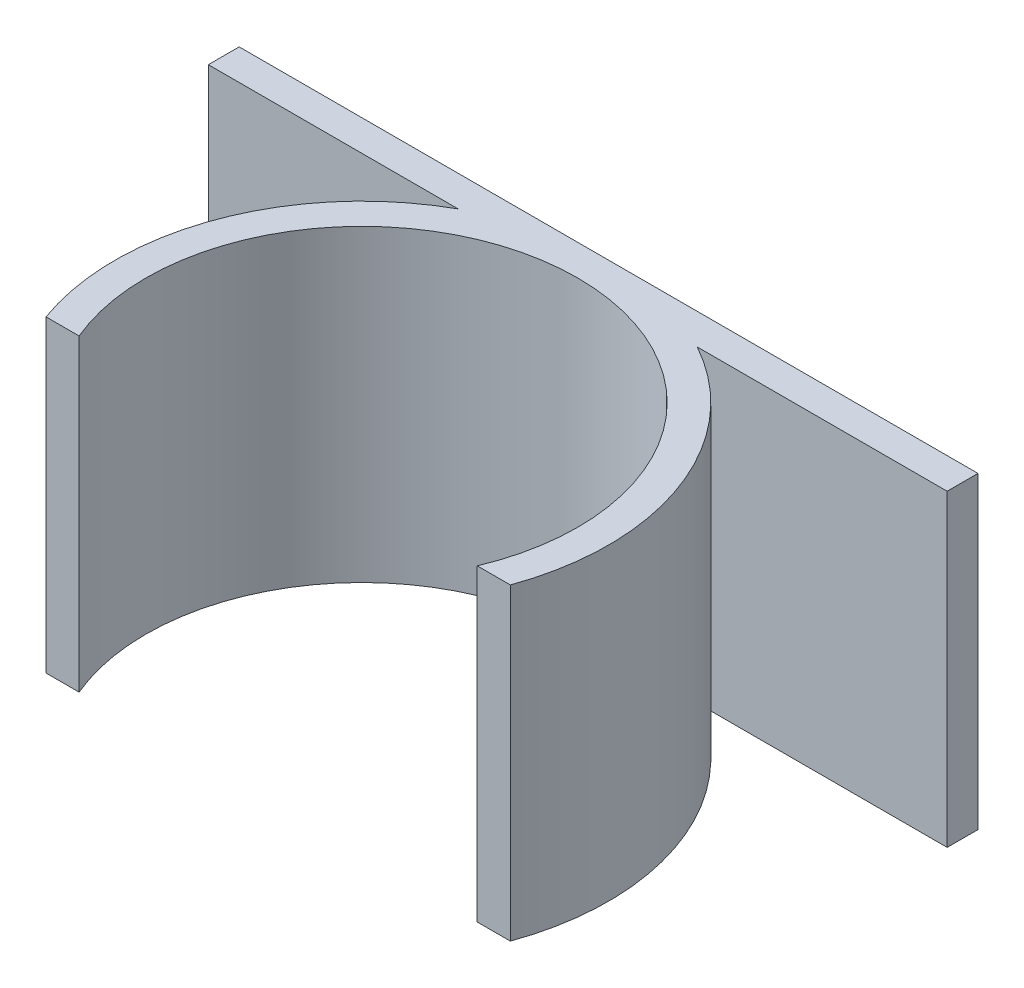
from build123d import *

# Parameters (mm, degrees)
SKETCH_1_R          = 8
SKETCH_1_R_2        = 7
EXTRUDE_1_DEPTH     = 10
SKETCH_2_W          = 23.95065147
SKETCH_2_H          = 1
EXTRUDE_2_DEPTH     = 10
SKETCH_3_W          = 17.982622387
SKETCH_3_H          = 3.285983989
CUT_EXTRUDE_1_DEPTH = 10
SKETCH_4_W          = 19.678126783
SKETCH_4_H          = 2.002644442
CUT_EXTRUDE_2_DEPTH = 10


with BuildPart() as part:
    # Sketch 1 → Extrude 1 (new body)
    with BuildSketch(Plane(origin=(0, 0, 0), x_dir=(1, 0, 0), z_dir=(0, 1, 0))):
        with Locations(Location((0, 0, 0), (0, 0, 270))):
            Circle(SKETCH_1_R)
        with Locations(Location((0, 0, 0), (0, 0, 270))):
            Circle(SKETCH_1_R_2, mode=Mode.SUBTRACT)
    extrude(amount=EXTRUDE_1_DEPTH)

    # Sketch 2 → Extrude 2 (add)
    with BuildSketch(Plane.XZ):
        with Locations((0, -7.5)):
            Rectangle(SKETCH_2_W, SKETCH_2_H)
    extrude(amount=-EXTRUDE_2_DEPTH)

    # Sketch 3 → Cut-Extrude 1 (cut)
    with BuildSketch(Plane(origin=(0, 10, 0), x_dir=(1, 0, 0), z_dir=(0, 1, 0))):
        with Locations((0.051378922, -6.357008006)):
            Rectangle(SKETCH_3_W, SKETCH_3_H)
    extrude(amount=-CUT_EXTRUDE_1_DEPTH, mode=Mode.SUBTRACT)

    # Sketch 4 → Cut-Extrude 2 (cut)
    with BuildSketch(Plane(origin=(0, 10, 0), x_dir=(1, 0, 0), z_dir=(0, 1, 0))):
        with Locations((0.642236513, -3.71269379)):
            Rectangle(SKETCH_4_W, SKETCH_4_H)
    extrude(amount=-CUT_EXTRUDE_2_DEPTH, mode=Mode.SUBTRACT)


solid = part.part
